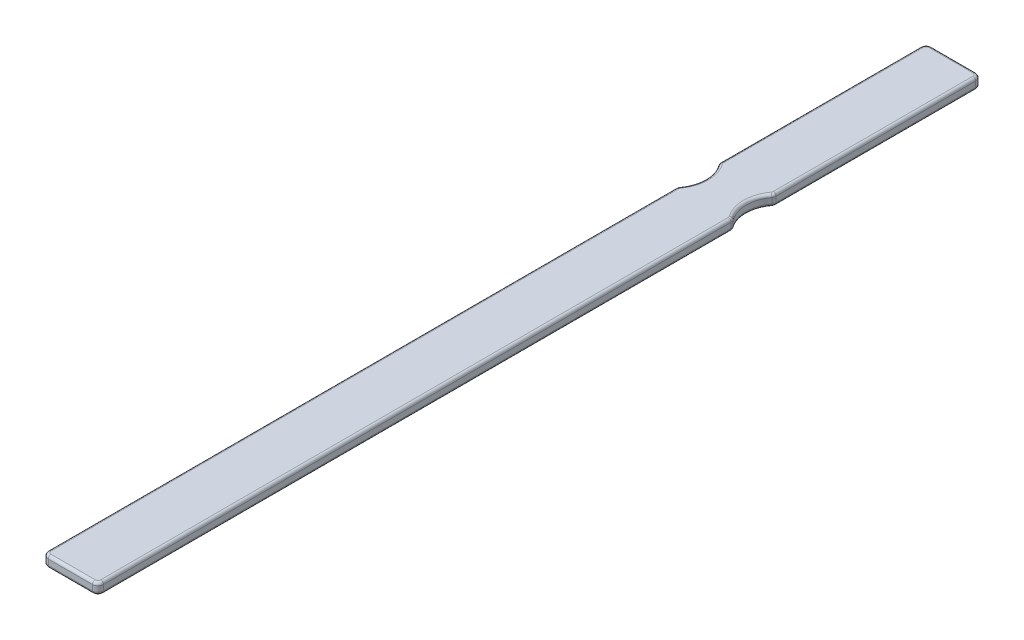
ISO-10303-21;
HEADER;
FILE_DESCRIPTION(('STEP AP214'),'2;1');
FILE_NAME('part.step','',(''),(''),'','','');
FILE_SCHEMA(('AUTOMOTIVE_DESIGN { 1 0 10303 214 1 1 1 1 }'));
ENDSEC;
DATA;
#1=APPLICATION_CONTEXT('core data for automotive mechanical design processes');
#2=APPLICATION_PROTOCOL_DEFINITION('international standard','automotive_design',2000,#1);
#3=PRODUCT_CONTEXT('',#1,'mechanical');
#4=PRODUCT('Part','Part','',(#3));
#5=PRODUCT_RELATED_PRODUCT_CATEGORY('part','',(#4));
#6=PRODUCT_DEFINITION_FORMATION('','',#4);
#7=PRODUCT_DEFINITION_CONTEXT('part definition',#1,'design');
#8=PRODUCT_DEFINITION('design','',#6,#7);
#9=PRODUCT_DEFINITION_SHAPE('','',#8);
#10=(LENGTH_UNIT() NAMED_UNIT(*) SI_UNIT(.MILLI.,.METRE.));
#11=(NAMED_UNIT(*) PLANE_ANGLE_UNIT() SI_UNIT($,.RADIAN.));
#12=(NAMED_UNIT(*) SI_UNIT($,.STERADIAN.) SOLID_ANGLE_UNIT());
#13=UNCERTAINTY_MEASURE_WITH_UNIT(LENGTH_MEASURE(1.E-05),#10,'distance_accuracy_value','');
#14=(GEOMETRIC_REPRESENTATION_CONTEXT(3) GLOBAL_UNCERTAINTY_ASSIGNED_CONTEXT((#13)) GLOBAL_UNIT_ASSIGNED_CONTEXT((#10,
#11,#12)) REPRESENTATION_CONTEXT('',''));
#15=CARTESIAN_POINT('',(0.,0.,0.));
#16=DIRECTION('',(0.,0.,1.));
#17=DIRECTION('',(1.,0.,0.));
#18=AXIS2_PLACEMENT_3D('',#15,#16,#17);
#19=CARTESIAN_POINT('',(-10.,4.,0.));
#20=DIRECTION('',(1.,0.,0.));
#21=DIRECTION('',(0.,0.,-1.));
#22=AXIS2_PLACEMENT_3D('',#19,#20,#21);
#23=PLANE('',#22);
#24=DIRECTION('',(0.,-1.,0.));
#25=VECTOR('',#24,1.);
#26=CARTESIAN_POINT('',(-10.,4.,-229.328096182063));
#27=LINE('',#26,#25);
#28=CARTESIAN_POINT('',(-10.,3.,-229.328096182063));
#29=VERTEX_POINT('',#28);
#30=CARTESIAN_POINT('',(-10.,1.,-229.328096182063));
#31=VERTEX_POINT('',#30);
#32=EDGE_CURVE('E570',#29,#31,#27,.T.);
#33=ORIENTED_EDGE('',*,*,#32,.T.);
#34=DIRECTION('',(0.,0.,1.));
#35=VECTOR('',#34,1.);
#36=CARTESIAN_POINT('',(-10.,1.,-2.));
#37=LINE('',#36,#35);
#38=CARTESIAN_POINT('',(-10.,1.,-2.));
#39=VERTEX_POINT('',#38);
#40=EDGE_CURVE('E304',#31,#39,#37,.T.);
#41=ORIENTED_EDGE('',*,*,#40,.T.);
#42=DIRECTION('',(0.,-1.,0.));
#43=VECTOR('',#42,1.);
#44=CARTESIAN_POINT('',(-10.,4.,-2.));
#45=LINE('',#44,#43);
#46=CARTESIAN_POINT('',(-10.,3.,-2.));
#47=VERTEX_POINT('',#46);
#48=EDGE_CURVE('E567',#39,#47,#45,.F.);
#49=ORIENTED_EDGE('',*,*,#48,.T.);
#50=DIRECTION('',(0.,0.,1.));
#51=VECTOR('',#50,1.);
#52=CARTESIAN_POINT('',(-10.,3.,0.));
#53=LINE('',#52,#51);
#54=EDGE_CURVE('E302',#47,#29,#53,.F.);
#55=ORIENTED_EDGE('',*,*,#54,.T.);
#56=EDGE_LOOP('',(#33,#41,#49,#55));
#57=FACE_BOUND('',#56,.T.);
#58=ADVANCED_FACE('F35',(#57),#23,.F.);
#59=CARTESIAN_POINT('',(-10.,4.,0.));
#60=DIRECTION('',(0.,0.,-1.));
#61=DIRECTION('',(-1.,0.,0.));
#62=AXIS2_PLACEMENT_3D('',#59,#60,#61);
#63=PLANE('',#62);
#64=DIRECTION('',(0.,-1.,0.));
#65=VECTOR('',#64,1.);
#66=CARTESIAN_POINT('',(-8.,4.,0.));
#67=LINE('',#66,#65);
#68=CARTESIAN_POINT('',(-8.,3.,0.));
#69=VERTEX_POINT('',#68);
#70=CARTESIAN_POINT('',(-8.,1.,0.));
#71=VERTEX_POINT('',#70);
#72=EDGE_CURVE('E482',#69,#71,#67,.T.);
#73=ORIENTED_EDGE('',*,*,#72,.T.);
#74=DIRECTION('',(1.,0.,0.));
#75=VECTOR('',#74,1.);
#76=CARTESIAN_POINT('',(8.,1.,0.));
#77=LINE('',#76,#75);
#78=CARTESIAN_POINT('',(8.,1.,0.));
#79=VERTEX_POINT('',#78);
#80=EDGE_CURVE('E312',#71,#79,#77,.T.);
#81=ORIENTED_EDGE('',*,*,#80,.T.);
#82=DIRECTION('',(0.,-1.,0.));
#83=VECTOR('',#82,1.);
#84=CARTESIAN_POINT('',(8.,4.,0.));
#85=LINE('',#84,#83);
#86=CARTESIAN_POINT('',(8.,3.,0.));
#87=VERTEX_POINT('',#86);
#88=EDGE_CURVE('E478',#79,#87,#85,.F.);
#89=ORIENTED_EDGE('',*,*,#88,.T.);
#90=DIRECTION('',(1.,0.,0.));
#91=VECTOR('',#90,1.);
#92=CARTESIAN_POINT('',(-10.,3.,0.));
#93=LINE('',#92,#91);
#94=EDGE_CURVE('E310',#87,#69,#93,.F.);
#95=ORIENTED_EDGE('',*,*,#94,.T.);
#96=EDGE_LOOP('',(#73,#81,#89,#95));
#97=FACE_BOUND('',#96,.T.);
#98=ADVANCED_FACE('F619',(#97),#63,.F.);
#99=CARTESIAN_POINT('',(10.,4.,0.));
#100=DIRECTION('',(-1.,0.,0.));
#101=DIRECTION('',(0.,0.,1.));
#102=AXIS2_PLACEMENT_3D('',#99,#100,#101);
#103=PLANE('',#102);
#104=DIRECTION('',(0.,-1.,0.));
#105=VECTOR('',#104,1.);
#106=CARTESIAN_POINT('',(10.,4.,-2.));
#107=LINE('',#106,#105);
#108=CARTESIAN_POINT('',(10.,3.,-2.));
#109=VERTEX_POINT('',#108);
#110=CARTESIAN_POINT('',(10.,1.,-2.));
#111=VERTEX_POINT('',#110);
#112=EDGE_CURVE('E561',#109,#111,#107,.T.);
#113=ORIENTED_EDGE('',*,*,#112,.T.);
#114=DIRECTION('',(0.,0.,-1.));
#115=VECTOR('',#114,1.);
#116=CARTESIAN_POINT('',(10.,1.,-229.328096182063));
#117=LINE('',#116,#115);
#118=CARTESIAN_POINT('',(10.,1.,-229.328096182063));
#119=VERTEX_POINT('',#118);
#120=EDGE_CURVE('E320',#111,#119,#117,.T.);
#121=ORIENTED_EDGE('',*,*,#120,.T.);
#122=DIRECTION('',(0.,-1.,0.));
#123=VECTOR('',#122,1.);
#124=CARTESIAN_POINT('',(10.,4.,-229.328096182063));
#125=LINE('',#124,#123);
#126=CARTESIAN_POINT('',(10.,3.,-229.328096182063));
#127=VERTEX_POINT('',#126);
#128=EDGE_CURVE('E564',#119,#127,#125,.F.);
#129=ORIENTED_EDGE('',*,*,#128,.T.);
#130=DIRECTION('',(0.,0.,-1.));
#131=VECTOR('',#130,1.);
#132=CARTESIAN_POINT('',(10.,3.,0.));
#133=LINE('',#132,#131);
#134=EDGE_CURVE('E318',#127,#109,#133,.F.);
#135=ORIENTED_EDGE('',*,*,#134,.T.);
#136=EDGE_LOOP('',(#113,#121,#129,#135));
#137=FACE_BOUND('',#136,.T.);
#138=ADVANCED_FACE('F705',(#137),#103,.F.);
#139=CARTESIAN_POINT('',(19.3674969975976,4.,-237.5));
#140=DIRECTION('',(0.,-1.,0.));
#141=DIRECTION('',(0.,0.,-1.));
#142=AXIS2_PLACEMENT_3D('',#139,#140,#141);
#143=CYLINDRICAL_SURFACE('',#142,12.);
#144=DIRECTION('',(0.,-1.,0.));
#145=VECTOR('',#144,1.);
#146=CARTESIAN_POINT('',(9.62392814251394,4.,-230.495511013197));
#147=LINE('',#146,#145);
#148=CARTESIAN_POINT('',(9.62392814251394,3.,-230.495511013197));
#149=VERTEX_POINT('',#148);
#150=CARTESIAN_POINT('',(9.62392814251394,1.,-230.495511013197));
#151=VERTEX_POINT('',#150);
#152=EDGE_CURVE('E553',#149,#151,#147,.T.);
#153=ORIENTED_EDGE('',*,*,#152,.T.);
#154=CARTESIAN_POINT('',(19.3674969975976,1.,-237.5));
#155=DIRECTION('',(0.,-1.,0.));
#156=DIRECTION('',(0.,0.,-1.));
#157=AXIS2_PLACEMENT_3D('',#154,#155,#156);
#158=CIRCLE('',#157,12.);
#159=CARTESIAN_POINT('',(9.62392814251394,1.,-244.504488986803));
#160=VERTEX_POINT('',#159);
#161=EDGE_CURVE('E329',#151,#160,#158,.T.);
#162=ORIENTED_EDGE('',*,*,#161,.T.);
#163=DIRECTION('',(0.,-1.,0.));
#164=VECTOR('',#163,1.);
#165=CARTESIAN_POINT('',(9.62392814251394,4.,-244.504488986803));
#166=LINE('',#165,#164);
#167=CARTESIAN_POINT('',(9.62392814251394,3.,-244.504488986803));
#168=VERTEX_POINT('',#167);
#169=EDGE_CURVE('E558',#160,#168,#166,.F.);
#170=ORIENTED_EDGE('',*,*,#169,.T.);
#171=CARTESIAN_POINT('',(19.3674969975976,3.,-237.5));
#172=DIRECTION('',(0.,-1.,0.));
#173=DIRECTION('',(0.,0.,-1.));
#174=AXIS2_PLACEMENT_3D('',#171,#172,#173);
#175=CIRCLE('',#174,12.);
#176=EDGE_CURVE('E327',#168,#149,#175,.F.);
#177=ORIENTED_EDGE('',*,*,#176,.T.);
#178=EDGE_LOOP('',(#153,#162,#170,#177));
#179=FACE_BOUND('',#178,.T.);
#180=ADVANCED_FACE('F650',(#179),#143,.F.);
#181=CARTESIAN_POINT('',(10.,4.,-245.));
#182=DIRECTION('',(-1.,0.,0.));
#183=DIRECTION('',(0.,0.,1.));
#184=AXIS2_PLACEMENT_3D('',#181,#182,#183);
#185=PLANE('',#184);
#186=DIRECTION('',(0.,-1.,0.));
#187=VECTOR('',#186,1.);
#188=CARTESIAN_POINT('',(10.,4.,-245.671903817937));
#189=LINE('',#188,#187);
#190=CARTESIAN_POINT('',(10.,3.,-245.671903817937));
#191=VERTEX_POINT('',#190);
#192=CARTESIAN_POINT('',(10.,1.,-245.671903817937));
#193=VERTEX_POINT('',#192);
#194=EDGE_CURVE('E551',#191,#193,#189,.T.);
#195=ORIENTED_EDGE('',*,*,#194,.T.);
#196=DIRECTION('',(0.,0.,-1.));
#197=VECTOR('',#196,1.);
#198=CARTESIAN_POINT('',(10.,1.,-318.));
#199=LINE('',#198,#197);
#200=CARTESIAN_POINT('',(10.,1.,-318.));
#201=VERTEX_POINT('',#200);
#202=EDGE_CURVE('E337',#193,#201,#199,.T.);
#203=ORIENTED_EDGE('',*,*,#202,.T.);
#204=DIRECTION('',(0.,-1.,0.));
#205=VECTOR('',#204,1.);
#206=CARTESIAN_POINT('',(10.,4.,-318.));
#207=LINE('',#206,#205);
#208=CARTESIAN_POINT('',(10.,3.,-318.));
#209=VERTEX_POINT('',#208);
#210=EDGE_CURVE('E408',#201,#209,#207,.F.);
#211=ORIENTED_EDGE('',*,*,#210,.T.);
#212=DIRECTION('',(0.,0.,-1.));
#213=VECTOR('',#212,1.);
#214=CARTESIAN_POINT('',(10.,3.,-245.));
#215=LINE('',#214,#213);
#216=EDGE_CURVE('E335',#209,#191,#215,.F.);
#217=ORIENTED_EDGE('',*,*,#216,.T.);
#218=EDGE_LOOP('',(#195,#203,#211,#217));
#219=FACE_BOUND('',#218,.T.);
#220=ADVANCED_FACE('F549',(#219),#185,.F.);
#221=CARTESIAN_POINT('',(-10.,4.,-320.));
#222=DIRECTION('',(0.,0.,1.));
#223=DIRECTION('',(1.,0.,0.));
#224=AXIS2_PLACEMENT_3D('',#221,#222,#223);
#225=PLANE('',#224);
#226=DIRECTION('',(0.,-1.,0.));
#227=VECTOR('',#226,1.);
#228=CARTESIAN_POINT('',(8.,4.,-320.));
#229=LINE('',#228,#227);
#230=CARTESIAN_POINT('',(8.,3.,-320.));
#231=VERTEX_POINT('',#230);
#232=CARTESIAN_POINT('',(8.,1.,-320.));
#233=VERTEX_POINT('',#232);
#234=EDGE_CURVE('E264',#231,#233,#229,.T.);
#235=ORIENTED_EDGE('',*,*,#234,.T.);
#236=DIRECTION('',(-1.,0.,0.));
#237=VECTOR('',#236,1.);
#238=CARTESIAN_POINT('',(-8.,1.,-320.));
#239=LINE('',#238,#237);
#240=CARTESIAN_POINT('',(-8.,1.,-320.));
#241=VERTEX_POINT('',#240);
#242=EDGE_CURVE('E280',#233,#241,#239,.T.);
#243=ORIENTED_EDGE('',*,*,#242,.T.);
#244=DIRECTION('',(0.,-1.,0.));
#245=VECTOR('',#244,1.);
#246=CARTESIAN_POINT('',(-8.,4.,-320.));
#247=LINE('',#246,#245);
#248=CARTESIAN_POINT('',(-8.,3.,-320.));
#249=VERTEX_POINT('',#248);
#250=EDGE_CURVE('E490',#241,#249,#247,.F.);
#251=ORIENTED_EDGE('',*,*,#250,.T.);
#252=DIRECTION('',(-1.,0.,0.));
#253=VECTOR('',#252,1.);
#254=CARTESIAN_POINT('',(-10.,3.,-320.));
#255=LINE('',#254,#253);
#256=EDGE_CURVE('E278',#249,#231,#255,.F.);
#257=ORIENTED_EDGE('',*,*,#256,.T.);
#258=EDGE_LOOP('',(#235,#243,#251,#257));
#259=FACE_BOUND('',#258,.T.);
#260=ADVANCED_FACE('F535',(#259),#225,.F.);
#261=CARTESIAN_POINT('',(-10.,4.,-245.));
#262=DIRECTION('',(1.,0.,0.));
#263=DIRECTION('',(0.,0.,-1.));
#264=AXIS2_PLACEMENT_3D('',#261,#262,#263);
#265=PLANE('',#264);
#266=DIRECTION('',(0.,-1.,0.));
#267=VECTOR('',#266,1.);
#268=CARTESIAN_POINT('',(-10.,4.,-318.));
#269=LINE('',#268,#267);
#270=CARTESIAN_POINT('',(-10.,3.,-318.));
#271=VERTEX_POINT('',#270);
#272=CARTESIAN_POINT('',(-10.,1.,-318.));
#273=VERTEX_POINT('',#272);
#274=EDGE_CURVE('E479',#271,#273,#269,.T.);
#275=ORIENTED_EDGE('',*,*,#274,.T.);
#276=DIRECTION('',(0.,0.,1.));
#277=VECTOR('',#276,1.);
#278=CARTESIAN_POINT('',(-10.,1.,-245.671903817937));
#279=LINE('',#278,#277);
#280=CARTESIAN_POINT('',(-10.,1.,-245.671903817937));
#281=VERTEX_POINT('',#280);
#282=EDGE_CURVE('E288',#273,#281,#279,.T.);
#283=ORIENTED_EDGE('',*,*,#282,.T.);
#284=DIRECTION('',(0.,-1.,0.));
#285=VECTOR('',#284,1.);
#286=CARTESIAN_POINT('',(-10.,4.,-245.671903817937));
#287=LINE('',#286,#285);
#288=CARTESIAN_POINT('',(-10.,3.,-245.671903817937));
#289=VERTEX_POINT('',#288);
#290=EDGE_CURVE('E469',#281,#289,#287,.F.);
#291=ORIENTED_EDGE('',*,*,#290,.T.);
#292=DIRECTION('',(0.,0.,1.));
#293=VECTOR('',#292,1.);
#294=CARTESIAN_POINT('',(-10.,3.,-245.));
#295=LINE('',#294,#293);
#296=EDGE_CURVE('E286',#289,#271,#295,.F.);
#297=ORIENTED_EDGE('',*,*,#296,.T.);
#298=EDGE_LOOP('',(#275,#283,#291,#297));
#299=FACE_BOUND('',#298,.T.);
#300=ADVANCED_FACE('F475',(#299),#265,.F.);
#301=CARTESIAN_POINT('',(-19.3674969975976,4.,-237.5));
#302=DIRECTION('',(0.,-1.,0.));
#303=DIRECTION('',(0.,0.,-1.));
#304=AXIS2_PLACEMENT_3D('',#301,#302,#303);
#305=CYLINDRICAL_SURFACE('',#304,12.);
#306=DIRECTION('',(0.,-1.,0.));
#307=VECTOR('',#306,1.);
#308=CARTESIAN_POINT('',(-9.62392814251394,4.,-244.504488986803));
#309=LINE('',#308,#307);
#310=CARTESIAN_POINT('',(-9.62392814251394,3.,-244.504488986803));
#311=VERTEX_POINT('',#310);
#312=CARTESIAN_POINT('',(-9.62392814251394,1.,-244.504488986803));
#313=VERTEX_POINT('',#312);
#314=EDGE_CURVE('E472',#311,#313,#309,.T.);
#315=ORIENTED_EDGE('',*,*,#314,.T.);
#316=CARTESIAN_POINT('',(-19.3674969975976,1.,-237.5));
#317=DIRECTION('',(0.,-1.,0.));
#318=DIRECTION('',(0.,0.,-1.));
#319=AXIS2_PLACEMENT_3D('',#316,#317,#318);
#320=CIRCLE('',#319,12.);
#321=CARTESIAN_POINT('',(-9.62392814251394,1.,-230.495511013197));
#322=VERTEX_POINT('',#321);
#323=EDGE_CURVE('E296',#313,#322,#320,.T.);
#324=ORIENTED_EDGE('',*,*,#323,.T.);
#325=DIRECTION('',(0.,-1.,0.));
#326=VECTOR('',#325,1.);
#327=CARTESIAN_POINT('',(-9.62392814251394,4.,-230.495511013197));
#328=LINE('',#327,#326);
#329=CARTESIAN_POINT('',(-9.62392814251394,3.,-230.495511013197));
#330=VERTEX_POINT('',#329);
#331=EDGE_CURVE('E484',#322,#330,#328,.F.);
#332=ORIENTED_EDGE('',*,*,#331,.T.);
#333=CARTESIAN_POINT('',(-19.3674969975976,3.,-237.5));
#334=DIRECTION('',(0.,-1.,0.));
#335=DIRECTION('',(0.,0.,-1.));
#336=AXIS2_PLACEMENT_3D('',#333,#334,#335);
#337=CIRCLE('',#336,12.);
#338=EDGE_CURVE('E294',#330,#311,#337,.F.);
#339=ORIENTED_EDGE('',*,*,#338,.T.);
#340=EDGE_LOOP('',(#315,#324,#332,#339));
#341=FACE_BOUND('',#340,.T.);
#342=ADVANCED_FACE('F576',(#341),#305,.F.);
#343=CARTESIAN_POINT('',(-19.3674969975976,4.,-237.5));
#344=DIRECTION('',(0.,-1.,0.));
#345=DIRECTION('',(0.,0.,-1.));
#346=AXIS2_PLACEMENT_3D('',#343,#344,#345);
#347=PLANE('',#346);
#348=DIRECTION('',(0.,0.,-1.));
#349=VECTOR('',#348,1.);
#350=CARTESIAN_POINT('',(9.,4.,-237.5));
#351=LINE('',#350,#349);
#352=CARTESIAN_POINT('',(9.,4.,-2.));
#353=VERTEX_POINT('',#352);
#354=CARTESIAN_POINT('',(9.,4.,-229.328096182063));
#355=VERTEX_POINT('',#354);
#356=EDGE_CURVE('E44',#353,#355,#351,.T.);
#357=ORIENTED_EDGE('',*,*,#356,.T.);
#358=CARTESIAN_POINT('',(8.,4.,-229.328096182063));
#359=DIRECTION('',(0.,-1.,0.));
#360=DIRECTION('',(0.,0.,-1.));
#361=AXIS2_PLACEMENT_3D('',#358,#359,#360);
#362=CIRCLE('',#361,1.);
#363=CARTESIAN_POINT('',(8.81196407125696,4.,-229.91180359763));
#364=VERTEX_POINT('',#363);
#365=EDGE_CURVE('E11',#355,#364,#362,.F.);
#366=ORIENTED_EDGE('',*,*,#365,.T.);
#367=CARTESIAN_POINT('',(19.3674969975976,4.,-237.5));
#368=DIRECTION('',(0.,-1.,0.));
#369=DIRECTION('',(0.,0.,-1.));
#370=AXIS2_PLACEMENT_3D('',#367,#368,#369);
#371=CIRCLE('',#370,13.);
#372=CARTESIAN_POINT('',(8.81196407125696,4.,-245.08819640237));
#373=VERTEX_POINT('',#372);
#374=EDGE_CURVE('E339',#364,#373,#371,.T.);
#375=ORIENTED_EDGE('',*,*,#374,.T.);
#376=CARTESIAN_POINT('',(8.,4.,-245.671903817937));
#377=DIRECTION('',(0.,-1.,0.));
#378=DIRECTION('',(0.,0.,-1.));
#379=AXIS2_PLACEMENT_3D('',#376,#377,#378);
#380=CIRCLE('',#379,1.);
#381=CARTESIAN_POINT('',(9.,4.,-245.671903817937));
#382=VERTEX_POINT('',#381);
#383=EDGE_CURVE('E341',#373,#382,#380,.F.);
#384=ORIENTED_EDGE('',*,*,#383,.T.);
#385=DIRECTION('',(0.,0.,-1.));
#386=VECTOR('',#385,1.);
#387=CARTESIAN_POINT('',(9.,4.,-237.5));
#388=LINE('',#387,#386);
#389=CARTESIAN_POINT('',(9.,4.,-318.));
#390=VERTEX_POINT('',#389);
#391=EDGE_CURVE('E343',#382,#390,#388,.T.);
#392=ORIENTED_EDGE('',*,*,#391,.T.);
#393=CARTESIAN_POINT('',(8.,4.,-318.));
#394=DIRECTION('',(0.,-1.,0.));
#395=DIRECTION('',(0.,0.,-1.));
#396=AXIS2_PLACEMENT_3D('',#393,#394,#395);
#397=CIRCLE('',#396,1.);
#398=CARTESIAN_POINT('',(8.,4.,-319.));
#399=VERTEX_POINT('',#398);
#400=EDGE_CURVE('E345',#390,#399,#397,.F.);
#401=ORIENTED_EDGE('',*,*,#400,.T.);
#402=DIRECTION('',(-1.,0.,0.));
#403=VECTOR('',#402,1.);
#404=CARTESIAN_POINT('',(-19.3674969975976,4.,-319.));
#405=LINE('',#404,#403);
#406=CARTESIAN_POINT('',(-8.,4.,-319.));
#407=VERTEX_POINT('',#406);
#408=EDGE_CURVE('E347',#399,#407,#405,.T.);
#409=ORIENTED_EDGE('',*,*,#408,.T.);
#410=CARTESIAN_POINT('',(-8.,4.,-318.));
#411=DIRECTION('',(0.,-1.,0.));
#412=DIRECTION('',(0.,0.,-1.));
#413=AXIS2_PLACEMENT_3D('',#410,#411,#412);
#414=CIRCLE('',#413,1.);
#415=CARTESIAN_POINT('',(-9.,4.,-318.));
#416=VERTEX_POINT('',#415);
#417=EDGE_CURVE('E349',#407,#416,#414,.F.);
#418=ORIENTED_EDGE('',*,*,#417,.T.);
#419=DIRECTION('',(0.,0.,1.));
#420=VECTOR('',#419,1.);
#421=CARTESIAN_POINT('',(-9.,4.,-237.5));
#422=LINE('',#421,#420);
#423=CARTESIAN_POINT('',(-9.,4.,-245.671903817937));
#424=VERTEX_POINT('',#423);
#425=EDGE_CURVE('E351',#416,#424,#422,.T.);
#426=ORIENTED_EDGE('',*,*,#425,.T.);
#427=CARTESIAN_POINT('',(-8.,4.,-245.671903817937));
#428=DIRECTION('',(0.,-1.,0.));
#429=DIRECTION('',(0.,0.,-1.));
#430=AXIS2_PLACEMENT_3D('',#427,#428,#429);
#431=CIRCLE('',#430,1.);
#432=CARTESIAN_POINT('',(-8.81196407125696,4.,-245.08819640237));
#433=VERTEX_POINT('',#432);
#434=EDGE_CURVE('E353',#424,#433,#431,.F.);
#435=ORIENTED_EDGE('',*,*,#434,.T.);
#436=CARTESIAN_POINT('',(-19.3674969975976,4.,-237.5));
#437=DIRECTION('',(0.,-1.,0.));
#438=DIRECTION('',(0.,0.,-1.));
#439=AXIS2_PLACEMENT_3D('',#436,#437,#438);
#440=CIRCLE('',#439,13.);
#441=CARTESIAN_POINT('',(-8.81196407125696,4.,-229.91180359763));
#442=VERTEX_POINT('',#441);
#443=EDGE_CURVE('E355',#433,#442,#440,.T.);
#444=ORIENTED_EDGE('',*,*,#443,.T.);
#445=CARTESIAN_POINT('',(-8.,4.,-229.328096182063));
#446=DIRECTION('',(0.,-1.,0.));
#447=DIRECTION('',(0.,0.,-1.));
#448=AXIS2_PLACEMENT_3D('',#445,#446,#447);
#449=CIRCLE('',#448,1.);
#450=CARTESIAN_POINT('',(-9.,4.,-229.328096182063));
#451=VERTEX_POINT('',#450);
#452=EDGE_CURVE('E357',#442,#451,#449,.F.);
#453=ORIENTED_EDGE('',*,*,#452,.T.);
#454=DIRECTION('',(0.,0.,1.));
#455=VECTOR('',#454,1.);
#456=CARTESIAN_POINT('',(-9.,4.,-237.5));
#457=LINE('',#456,#455);
#458=CARTESIAN_POINT('',(-9.,4.,-2.));
#459=VERTEX_POINT('',#458);
#460=EDGE_CURVE('E359',#451,#459,#457,.T.);
#461=ORIENTED_EDGE('',*,*,#460,.T.);
#462=CARTESIAN_POINT('',(-8.,4.,-2.));
#463=DIRECTION('',(0.,-1.,0.));
#464=DIRECTION('',(0.,0.,-1.));
#465=AXIS2_PLACEMENT_3D('',#462,#463,#464);
#466=CIRCLE('',#465,1.);
#467=CARTESIAN_POINT('',(-8.,4.,-1.));
#468=VERTEX_POINT('',#467);
#469=EDGE_CURVE('E361',#459,#468,#466,.F.);
#470=ORIENTED_EDGE('',*,*,#469,.T.);
#471=DIRECTION('',(1.,0.,0.));
#472=VECTOR('',#471,1.);
#473=CARTESIAN_POINT('',(-19.3674969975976,4.,-1.));
#474=LINE('',#473,#472);
#475=CARTESIAN_POINT('',(8.,4.,-1.));
#476=VERTEX_POINT('',#475);
#477=EDGE_CURVE('E363',#468,#476,#474,.T.);
#478=ORIENTED_EDGE('',*,*,#477,.T.);
#479=CARTESIAN_POINT('',(8.,4.,-2.));
#480=DIRECTION('',(0.,-1.,0.));
#481=DIRECTION('',(0.,0.,-1.));
#482=AXIS2_PLACEMENT_3D('',#479,#480,#481);
#483=CIRCLE('',#482,1.);
#484=EDGE_CURVE('E55',#476,#353,#483,.F.);
#485=ORIENTED_EDGE('',*,*,#484,.T.);
#486=EDGE_LOOP('',(#357,#366,#375,#384,#392,#401,#409,#418,#426,#435,#444,#453,#461,#470,#478,#485));
#487=FACE_BOUND('',#486,.T.);
#488=ADVANCED_FACE('F637',(#487),#347,.F.);
#489=CARTESIAN_POINT('',(-19.3674969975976,0.,-237.5));
#490=DIRECTION('',(0.,-1.,0.));
#491=DIRECTION('',(0.,0.,-1.));
#492=AXIS2_PLACEMENT_3D('',#489,#490,#491);
#493=PLANE('',#492);
#494=DIRECTION('',(-1.,0.,0.));
#495=VECTOR('',#494,1.);
#496=CARTESIAN_POINT('',(8.,0.,-319.));
#497=LINE('',#496,#495);
#498=CARTESIAN_POINT('',(-8.,0.,-319.));
#499=VERTEX_POINT('',#498);
#500=CARTESIAN_POINT('',(8.,0.,-319.));
#501=VERTEX_POINT('',#500);
#502=EDGE_CURVE('E268',#499,#501,#497,.F.);
#503=ORIENTED_EDGE('',*,*,#502,.T.);
#504=CARTESIAN_POINT('',(8.,0.,-318.));
#505=DIRECTION('',(0.,-1.,0.));
#506=DIRECTION('',(0.,0.,-1.));
#507=AXIS2_PLACEMENT_3D('',#504,#505,#506);
#508=CIRCLE('',#507,1.);
#509=CARTESIAN_POINT('',(9.,0.,-318.));
#510=VERTEX_POINT('',#509);
#511=EDGE_CURVE('E249',#501,#510,#508,.T.);
#512=ORIENTED_EDGE('',*,*,#511,.T.);
#513=DIRECTION('',(0.,0.,-1.));
#514=VECTOR('',#513,1.);
#515=CARTESIAN_POINT('',(9.,0.,-245.671903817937));
#516=LINE('',#515,#514);
#517=CARTESIAN_POINT('',(9.,0.,-245.671903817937));
#518=VERTEX_POINT('',#517);
#519=EDGE_CURVE('E257',#510,#518,#516,.F.);
#520=ORIENTED_EDGE('',*,*,#519,.T.);
#521=CARTESIAN_POINT('',(8.,0.,-245.671903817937));
#522=DIRECTION('',(0.,-1.,0.));
#523=DIRECTION('',(0.,0.,-1.));
#524=AXIS2_PLACEMENT_3D('',#521,#522,#523);
#525=CIRCLE('',#524,1.);
#526=CARTESIAN_POINT('',(8.81196407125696,0.,-245.08819640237));
#527=VERTEX_POINT('',#526);
#528=EDGE_CURVE('E263',#518,#527,#525,.T.);
#529=ORIENTED_EDGE('',*,*,#528,.T.);
#530=CARTESIAN_POINT('',(19.3674969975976,0.,-237.5));
#531=DIRECTION('',(0.,-1.,0.));
#532=DIRECTION('',(0.,0.,-1.));
#533=AXIS2_PLACEMENT_3D('',#530,#531,#532);
#534=CIRCLE('',#533,13.);
#535=CARTESIAN_POINT('',(8.81196407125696,0.,-229.91180359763));
#536=VERTEX_POINT('',#535);
#537=EDGE_CURVE('E496',#527,#536,#534,.F.);
#538=ORIENTED_EDGE('',*,*,#537,.T.);
#539=CARTESIAN_POINT('',(8.,0.,-229.328096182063));
#540=DIRECTION('',(0.,-1.,0.));
#541=DIRECTION('',(0.,0.,-1.));
#542=AXIS2_PLACEMENT_3D('',#539,#540,#541);
#543=CIRCLE('',#542,1.);
#544=CARTESIAN_POINT('',(9.,0.,-229.328096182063));
#545=VERTEX_POINT('',#544);
#546=EDGE_CURVE('E498',#536,#545,#543,.T.);
#547=ORIENTED_EDGE('',*,*,#546,.T.);
#548=DIRECTION('',(0.,0.,-1.));
#549=VECTOR('',#548,1.);
#550=CARTESIAN_POINT('',(9.,0.,-2.));
#551=LINE('',#550,#549);
#552=CARTESIAN_POINT('',(9.,0.,-2.));
#553=VERTEX_POINT('',#552);
#554=EDGE_CURVE('E500',#545,#553,#551,.F.);
#555=ORIENTED_EDGE('',*,*,#554,.T.);
#556=CARTESIAN_POINT('',(8.,0.,-2.));
#557=DIRECTION('',(0.,-1.,0.));
#558=DIRECTION('',(0.,0.,-1.));
#559=AXIS2_PLACEMENT_3D('',#556,#557,#558);
#560=CIRCLE('',#559,1.);
#561=CARTESIAN_POINT('',(8.,0.,-1.));
#562=VERTEX_POINT('',#561);
#563=EDGE_CURVE('E502',#553,#562,#560,.T.);
#564=ORIENTED_EDGE('',*,*,#563,.T.);
#565=DIRECTION('',(1.,0.,0.));
#566=VECTOR('',#565,1.);
#567=CARTESIAN_POINT('',(-8.,0.,-1.));
#568=LINE('',#567,#566);
#569=CARTESIAN_POINT('',(-8.,0.,-1.));
#570=VERTEX_POINT('',#569);
#571=EDGE_CURVE('E504',#562,#570,#568,.F.);
#572=ORIENTED_EDGE('',*,*,#571,.T.);
#573=CARTESIAN_POINT('',(-8.,0.,-2.));
#574=DIRECTION('',(0.,-1.,0.));
#575=DIRECTION('',(0.,0.,-1.));
#576=AXIS2_PLACEMENT_3D('',#573,#574,#575);
#577=CIRCLE('',#576,1.);
#578=CARTESIAN_POINT('',(-9.,0.,-2.));
#579=VERTEX_POINT('',#578);
#580=EDGE_CURVE('E506',#570,#579,#577,.T.);
#581=ORIENTED_EDGE('',*,*,#580,.T.);
#582=DIRECTION('',(0.,0.,1.));
#583=VECTOR('',#582,1.);
#584=CARTESIAN_POINT('',(-9.,0.,-229.328096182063));
#585=LINE('',#584,#583);
#586=CARTESIAN_POINT('',(-9.,0.,-229.328096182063));
#587=VERTEX_POINT('',#586);
#588=EDGE_CURVE('E508',#579,#587,#585,.F.);
#589=ORIENTED_EDGE('',*,*,#588,.T.);
#590=CARTESIAN_POINT('',(-8.,0.,-229.328096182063));
#591=DIRECTION('',(0.,-1.,0.));
#592=DIRECTION('',(0.,0.,-1.));
#593=AXIS2_PLACEMENT_3D('',#590,#591,#592);
#594=CIRCLE('',#593,1.);
#595=CARTESIAN_POINT('',(-8.81196407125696,0.,-229.91180359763));
#596=VERTEX_POINT('',#595);
#597=EDGE_CURVE('E510',#587,#596,#594,.T.);
#598=ORIENTED_EDGE('',*,*,#597,.T.);
#599=CARTESIAN_POINT('',(-19.3674969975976,0.,-237.5));
#600=DIRECTION('',(0.,-1.,0.));
#601=DIRECTION('',(0.,0.,-1.));
#602=AXIS2_PLACEMENT_3D('',#599,#600,#601);
#603=CIRCLE('',#602,13.);
#604=CARTESIAN_POINT('',(-8.81196407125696,0.,-245.08819640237));
#605=VERTEX_POINT('',#604);
#606=EDGE_CURVE('E512',#596,#605,#603,.F.);
#607=ORIENTED_EDGE('',*,*,#606,.T.);
#608=CARTESIAN_POINT('',(-8.,0.,-245.671903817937));
#609=DIRECTION('',(0.,-1.,0.));
#610=DIRECTION('',(0.,0.,-1.));
#611=AXIS2_PLACEMENT_3D('',#608,#609,#610);
#612=CIRCLE('',#611,1.);
#613=CARTESIAN_POINT('',(-9.,0.,-245.671903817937));
#614=VERTEX_POINT('',#613);
#615=EDGE_CURVE('E514',#605,#614,#612,.T.);
#616=ORIENTED_EDGE('',*,*,#615,.T.);
#617=DIRECTION('',(0.,0.,1.));
#618=VECTOR('',#617,1.);
#619=CARTESIAN_POINT('',(-9.,0.,-318.));
#620=LINE('',#619,#618);
#621=CARTESIAN_POINT('',(-9.,0.,-318.));
#622=VERTEX_POINT('',#621);
#623=EDGE_CURVE('E516',#614,#622,#620,.F.);
#624=ORIENTED_EDGE('',*,*,#623,.T.);
#625=CARTESIAN_POINT('',(-8.,0.,-318.));
#626=DIRECTION('',(0.,-1.,0.));
#627=DIRECTION('',(0.,0.,-1.));
#628=AXIS2_PLACEMENT_3D('',#625,#626,#627);
#629=CIRCLE('',#628,1.);
#630=EDGE_CURVE('E273',#622,#499,#629,.T.);
#631=ORIENTED_EDGE('',*,*,#630,.T.);
#632=EDGE_LOOP('',(#503,#512,#520,#529,#538,#547,#555,#564,#572,#581,#589,#598,#607,#616,#624,#631));
#633=FACE_BOUND('',#632,.T.);
#634=ADVANCED_FACE('F266',(#633),#493,.T.);
#635=CARTESIAN_POINT('',(8.,4.,-245.671903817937));
#636=DIRECTION('',(0.,-1.,0.));
#637=DIRECTION('',(0.,0.,-1.));
#638=AXIS2_PLACEMENT_3D('',#635,#636,#637);
#639=CYLINDRICAL_SURFACE('',#638,2.);
#640=ORIENTED_EDGE('',*,*,#169,.F.);
#641=CARTESIAN_POINT('',(8.,1.,-245.671903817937));
#642=DIRECTION('',(0.,-1.,0.));
#643=DIRECTION('',(0.,0.,-1.));
#644=AXIS2_PLACEMENT_3D('',#641,#642,#643);
#645=CIRCLE('',#644,2.);
#646=EDGE_CURVE('E333',#160,#193,#645,.F.);
#647=ORIENTED_EDGE('',*,*,#646,.T.);
#648=ORIENTED_EDGE('',*,*,#194,.F.);
#649=CARTESIAN_POINT('',(8.,3.,-245.671903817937));
#650=DIRECTION('',(0.,-1.,0.));
#651=DIRECTION('',(0.,0.,-1.));
#652=AXIS2_PLACEMENT_3D('',#649,#650,#651);
#653=CIRCLE('',#652,2.);
#654=EDGE_CURVE('E331',#191,#168,#653,.T.);
#655=ORIENTED_EDGE('',*,*,#654,.T.);
#656=EDGE_LOOP('',(#640,#647,#648,#655));
#657=FACE_BOUND('',#656,.T.);
#658=ADVANCED_FACE('F668',(#657),#639,.T.);
#659=CARTESIAN_POINT('',(8.,4.,-229.328096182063));
#660=DIRECTION('',(0.,-1.,0.));
#661=DIRECTION('',(0.,0.,-1.));
#662=AXIS2_PLACEMENT_3D('',#659,#660,#661);
#663=CYLINDRICAL_SURFACE('',#662,2.);
#664=ORIENTED_EDGE('',*,*,#128,.F.);
#665=CARTESIAN_POINT('',(8.,1.,-229.328096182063));
#666=DIRECTION('',(0.,-1.,0.));
#667=DIRECTION('',(0.,0.,-1.));
#668=AXIS2_PLACEMENT_3D('',#665,#666,#667);
#669=CIRCLE('',#668,2.);
#670=EDGE_CURVE('E325',#119,#151,#669,.F.);
#671=ORIENTED_EDGE('',*,*,#670,.T.);
#672=ORIENTED_EDGE('',*,*,#152,.F.);
#673=CARTESIAN_POINT('',(8.,3.,-229.328096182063));
#674=DIRECTION('',(0.,-1.,0.));
#675=DIRECTION('',(0.,0.,-1.));
#676=AXIS2_PLACEMENT_3D('',#673,#674,#675);
#677=CIRCLE('',#676,2.);
#678=EDGE_CURVE('E322',#149,#127,#677,.T.);
#679=ORIENTED_EDGE('',*,*,#678,.T.);
#680=EDGE_LOOP('',(#664,#671,#672,#679));
#681=FACE_BOUND('',#680,.T.);
#682=ADVANCED_FACE('F655',(#681),#663,.T.);
#683=CARTESIAN_POINT('',(-8.,4.,-229.328096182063));
#684=DIRECTION('',(0.,-1.,0.));
#685=DIRECTION('',(0.,0.,-1.));
#686=AXIS2_PLACEMENT_3D('',#683,#684,#685);
#687=CYLINDRICAL_SURFACE('',#686,2.);
#688=ORIENTED_EDGE('',*,*,#331,.F.);
#689=CARTESIAN_POINT('',(-8.,1.,-229.328096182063));
#690=DIRECTION('',(0.,-1.,0.));
#691=DIRECTION('',(0.,0.,-1.));
#692=AXIS2_PLACEMENT_3D('',#689,#690,#691);
#693=CIRCLE('',#692,2.);
#694=EDGE_CURVE('E300',#322,#31,#693,.F.);
#695=ORIENTED_EDGE('',*,*,#694,.T.);
#696=ORIENTED_EDGE('',*,*,#32,.F.);
#697=CARTESIAN_POINT('',(-8.,3.,-229.328096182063));
#698=DIRECTION('',(0.,-1.,0.));
#699=DIRECTION('',(0.,0.,-1.));
#700=AXIS2_PLACEMENT_3D('',#697,#698,#699);
#701=CIRCLE('',#700,2.);
#702=EDGE_CURVE('E298',#29,#330,#701,.T.);
#703=ORIENTED_EDGE('',*,*,#702,.T.);
#704=EDGE_LOOP('',(#688,#695,#696,#703));
#705=FACE_BOUND('',#704,.T.);
#706=ADVANCED_FACE('F580',(#705),#687,.T.);
#707=CARTESIAN_POINT('',(-8.,4.,-245.671903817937));
#708=DIRECTION('',(0.,-1.,0.));
#709=DIRECTION('',(0.,0.,-1.));
#710=AXIS2_PLACEMENT_3D('',#707,#708,#709);
#711=CYLINDRICAL_SURFACE('',#710,2.);
#712=ORIENTED_EDGE('',*,*,#290,.F.);
#713=CARTESIAN_POINT('',(-8.,1.,-245.671903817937));
#714=DIRECTION('',(0.,-1.,0.));
#715=DIRECTION('',(0.,0.,-1.));
#716=AXIS2_PLACEMENT_3D('',#713,#714,#715);
#717=CIRCLE('',#716,2.);
#718=EDGE_CURVE('E292',#281,#313,#717,.F.);
#719=ORIENTED_EDGE('',*,*,#718,.T.);
#720=ORIENTED_EDGE('',*,*,#314,.F.);
#721=CARTESIAN_POINT('',(-8.,3.,-245.671903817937));
#722=DIRECTION('',(0.,-1.,0.));
#723=DIRECTION('',(0.,0.,-1.));
#724=AXIS2_PLACEMENT_3D('',#721,#722,#723);
#725=CIRCLE('',#724,2.);
#726=EDGE_CURVE('E290',#311,#289,#725,.T.);
#727=ORIENTED_EDGE('',*,*,#726,.T.);
#728=EDGE_LOOP('',(#712,#719,#720,#727));
#729=FACE_BOUND('',#728,.T.);
#730=ADVANCED_FACE('F468',(#729),#711,.T.);
#731=CARTESIAN_POINT('',(-8.,4.,-2.));
#732=DIRECTION('',(0.,-1.,0.));
#733=DIRECTION('',(0.,0.,-1.));
#734=AXIS2_PLACEMENT_3D('',#731,#732,#733);
#735=CYLINDRICAL_SURFACE('',#734,2.);
#736=ORIENTED_EDGE('',*,*,#48,.F.);
#737=CARTESIAN_POINT('',(-8.,1.,-2.));
#738=DIRECTION('',(0.,-1.,0.));
#739=DIRECTION('',(0.,0.,-1.));
#740=AXIS2_PLACEMENT_3D('',#737,#738,#739);
#741=CIRCLE('',#740,2.);
#742=EDGE_CURVE('E308',#39,#71,#741,.F.);
#743=ORIENTED_EDGE('',*,*,#742,.T.);
#744=ORIENTED_EDGE('',*,*,#72,.F.);
#745=CARTESIAN_POINT('',(-8.,3.,-2.));
#746=DIRECTION('',(0.,-1.,0.));
#747=DIRECTION('',(0.,0.,-1.));
#748=AXIS2_PLACEMENT_3D('',#745,#746,#747);
#749=CIRCLE('',#748,2.);
#750=EDGE_CURVE('E306',#69,#47,#749,.T.);
#751=ORIENTED_EDGE('',*,*,#750,.T.);
#752=EDGE_LOOP('',(#736,#743,#744,#751));
#753=FACE_BOUND('',#752,.T.);
#754=ADVANCED_FACE('F605',(#753),#735,.T.);
#755=CARTESIAN_POINT('',(8.,4.,-2.));
#756=DIRECTION('',(0.,-1.,0.));
#757=DIRECTION('',(0.,0.,-1.));
#758=AXIS2_PLACEMENT_3D('',#755,#756,#757);
#759=CYLINDRICAL_SURFACE('',#758,2.);
#760=ORIENTED_EDGE('',*,*,#88,.F.);
#761=CARTESIAN_POINT('',(8.,1.,-2.));
#762=DIRECTION('',(0.,-1.,0.));
#763=DIRECTION('',(0.,0.,-1.));
#764=AXIS2_PLACEMENT_3D('',#761,#762,#763);
#765=CIRCLE('',#764,2.);
#766=EDGE_CURVE('E316',#79,#111,#765,.F.);
#767=ORIENTED_EDGE('',*,*,#766,.T.);
#768=ORIENTED_EDGE('',*,*,#112,.F.);
#769=CARTESIAN_POINT('',(8.,3.,-2.));
#770=DIRECTION('',(0.,-1.,0.));
#771=DIRECTION('',(0.,0.,-1.));
#772=AXIS2_PLACEMENT_3D('',#769,#770,#771);
#773=CIRCLE('',#772,2.);
#774=EDGE_CURVE('E314',#109,#87,#773,.T.);
#775=ORIENTED_EDGE('',*,*,#774,.T.);
#776=EDGE_LOOP('',(#760,#767,#768,#775));
#777=FACE_BOUND('',#776,.T.);
#778=ADVANCED_FACE('F622',(#777),#759,.T.);
#779=CARTESIAN_POINT('',(8.,4.,-318.));
#780=DIRECTION('',(0.,-1.,0.));
#781=DIRECTION('',(0.,0.,-1.));
#782=AXIS2_PLACEMENT_3D('',#779,#780,#781);
#783=CYLINDRICAL_SURFACE('',#782,2.);
#784=ORIENTED_EDGE('',*,*,#210,.F.);
#785=CARTESIAN_POINT('',(8.,1.,-318.));
#786=DIRECTION('',(0.,-1.,0.));
#787=DIRECTION('',(0.,0.,-1.));
#788=AXIS2_PLACEMENT_3D('',#785,#786,#787);
#789=CIRCLE('',#788,2.);
#790=EDGE_CURVE('E251',#201,#233,#789,.F.);
#791=ORIENTED_EDGE('',*,*,#790,.T.);
#792=ORIENTED_EDGE('',*,*,#234,.F.);
#793=CARTESIAN_POINT('',(8.,3.,-318.));
#794=DIRECTION('',(0.,-1.,0.));
#795=DIRECTION('',(0.,0.,-1.));
#796=AXIS2_PLACEMENT_3D('',#793,#794,#795);
#797=CIRCLE('',#796,2.);
#798=EDGE_CURVE('E270',#231,#209,#797,.T.);
#799=ORIENTED_EDGE('',*,*,#798,.T.);
#800=EDGE_LOOP('',(#784,#791,#792,#799));
#801=FACE_BOUND('',#800,.T.);
#802=ADVANCED_FACE('F532',(#801),#783,.T.);
#803=CARTESIAN_POINT('',(-8.,4.,-318.));
#804=DIRECTION('',(0.,-1.,0.));
#805=DIRECTION('',(0.,0.,-1.));
#806=AXIS2_PLACEMENT_3D('',#803,#804,#805);
#807=CYLINDRICAL_SURFACE('',#806,2.);
#808=ORIENTED_EDGE('',*,*,#250,.F.);
#809=CARTESIAN_POINT('',(-8.,1.,-318.));
#810=DIRECTION('',(0.,-1.,0.));
#811=DIRECTION('',(0.,0.,-1.));
#812=AXIS2_PLACEMENT_3D('',#809,#810,#811);
#813=CIRCLE('',#812,2.);
#814=EDGE_CURVE('E284',#241,#273,#813,.F.);
#815=ORIENTED_EDGE('',*,*,#814,.T.);
#816=ORIENTED_EDGE('',*,*,#274,.F.);
#817=CARTESIAN_POINT('',(-8.,3.,-318.));
#818=DIRECTION('',(0.,-1.,0.));
#819=DIRECTION('',(0.,0.,-1.));
#820=AXIS2_PLACEMENT_3D('',#817,#818,#819);
#821=CIRCLE('',#820,2.);
#822=EDGE_CURVE('E282',#271,#249,#821,.T.);
#823=ORIENTED_EDGE('',*,*,#822,.T.);
#824=EDGE_LOOP('',(#808,#815,#816,#823));
#825=FACE_BOUND('',#824,.T.);
#826=ADVANCED_FACE('F723',(#825),#807,.T.);
#827=CARTESIAN_POINT('',(-8.,1.,-2.));
#828=DIRECTION('',(0.,-1.,0.));
#829=DIRECTION('',(0.,0.,-1.));
#830=AXIS2_PLACEMENT_3D('',#827,#828,#829);
#831=DEGENERATE_TOROIDAL_SURFACE('',#830,1.,1.,.T.);
#832=CARTESIAN_POINT('',(-8.,1.,-1.));
#833=DIRECTION('',(1.,0.,0.));
#834=DIRECTION('',(0.,0.,-1.));
#835=AXIS2_PLACEMENT_3D('',#832,#833,#834);
#836=CIRCLE('',#835,1.);
#837=EDGE_CURVE('E402',#71,#570,#836,.T.);
#838=ORIENTED_EDGE('',*,*,#837,.F.);
#839=ORIENTED_EDGE('',*,*,#742,.F.);
#840=CARTESIAN_POINT('',(-9.,1.,-2.));
#841=DIRECTION('',(0.,0.,-1.));
#842=DIRECTION('',(-1.,0.,0.));
#843=AXIS2_PLACEMENT_3D('',#840,#841,#842);
#844=CIRCLE('',#843,1.);
#845=EDGE_CURVE('E405',#579,#39,#844,.T.);
#846=ORIENTED_EDGE('',*,*,#845,.F.);
#847=ORIENTED_EDGE('',*,*,#580,.F.);
#848=EDGE_LOOP('',(#838,#839,#846,#847));
#849=FACE_BOUND('',#848,.T.);
#850=ADVANCED_FACE('F610',(#849),#831,.T.);
#851=CARTESIAN_POINT('',(-9.,1.,0.));
#852=DIRECTION('',(0.,0.,-1.));
#853=DIRECTION('',(-1.,0.,0.));
#854=AXIS2_PLACEMENT_3D('',#851,#852,#853);
#855=CYLINDRICAL_SURFACE('',#854,1.);
#856=ORIENTED_EDGE('',*,*,#845,.T.);
#857=ORIENTED_EDGE('',*,*,#40,.F.);
#858=CARTESIAN_POINT('',(-9.,1.,-229.328096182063));
#859=DIRECTION('',(0.,0.,-1.));
#860=DIRECTION('',(-1.,0.,0.));
#861=AXIS2_PLACEMENT_3D('',#858,#859,#860);
#862=CIRCLE('',#861,1.);
#863=EDGE_CURVE('E399',#587,#31,#862,.T.);
#864=ORIENTED_EDGE('',*,*,#863,.F.);
#865=ORIENTED_EDGE('',*,*,#588,.F.);
#866=EDGE_LOOP('',(#856,#857,#864,#865));
#867=FACE_BOUND('',#866,.T.);
#868=ADVANCED_FACE('F599',(#867),#855,.T.);
#869=CARTESIAN_POINT('',(-10.,1.,-1.));
#870=DIRECTION('',(-1.,0.,0.));
#871=DIRECTION('',(0.,0.,1.));
#872=AXIS2_PLACEMENT_3D('',#869,#870,#871);
#873=CYLINDRICAL_SURFACE('',#872,1.);
#874=ORIENTED_EDGE('',*,*,#837,.T.);
#875=ORIENTED_EDGE('',*,*,#571,.F.);
#876=CARTESIAN_POINT('',(8.,1.,-1.));
#877=DIRECTION('',(1.,0.,0.));
#878=DIRECTION('',(0.,0.,-1.));
#879=AXIS2_PLACEMENT_3D('',#876,#877,#878);
#880=CIRCLE('',#879,1.);
#881=EDGE_CURVE('E396',#79,#562,#880,.T.);
#882=ORIENTED_EDGE('',*,*,#881,.F.);
#883=ORIENTED_EDGE('',*,*,#80,.F.);
#884=EDGE_LOOP('',(#874,#875,#882,#883));
#885=FACE_BOUND('',#884,.T.);
#886=ADVANCED_FACE('F615',(#885),#873,.T.);
#887=CARTESIAN_POINT('',(-8.,1.,-229.328096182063));
#888=DIRECTION('',(0.,-1.,0.));
#889=DIRECTION('',(0.,0.,-1.));
#890=AXIS2_PLACEMENT_3D('',#887,#888,#889);
#891=DEGENERATE_TOROIDAL_SURFACE('',#890,1.,1.,.T.);
#892=ORIENTED_EDGE('',*,*,#863,.T.);
#893=ORIENTED_EDGE('',*,*,#694,.F.);
#894=CARTESIAN_POINT('',(-8.81196407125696,1.,-229.91180359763));
#895=DIRECTION('',(0.583707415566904,0.,-0.811964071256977));
#896=DIRECTION('',(-0.811964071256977,0.,-0.583707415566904));
#897=AXIS2_PLACEMENT_3D('',#894,#895,#896);
#898=CIRCLE('',#897,1.);
#899=EDGE_CURVE('E393',#596,#322,#898,.T.);
#900=ORIENTED_EDGE('',*,*,#899,.F.);
#901=ORIENTED_EDGE('',*,*,#597,.F.);
#902=EDGE_LOOP('',(#892,#893,#900,#901));
#903=FACE_BOUND('',#902,.T.);
#904=ADVANCED_FACE('F585',(#903),#891,.T.);
#905=CARTESIAN_POINT('',(8.,1.,-2.));
#906=DIRECTION('',(0.,-1.,0.));
#907=DIRECTION('',(0.,0.,-1.));
#908=AXIS2_PLACEMENT_3D('',#905,#906,#907);
#909=DEGENERATE_TOROIDAL_SURFACE('',#908,1.,1.,.T.);
#910=ORIENTED_EDGE('',*,*,#881,.T.);
#911=ORIENTED_EDGE('',*,*,#563,.F.);
#912=CARTESIAN_POINT('',(9.,1.,-2.));
#913=DIRECTION('',(0.,0.,-1.));
#914=DIRECTION('',(-1.,0.,0.));
#915=AXIS2_PLACEMENT_3D('',#912,#913,#914);
#916=CIRCLE('',#915,1.);
#917=EDGE_CURVE('E390',#111,#553,#916,.T.);
#918=ORIENTED_EDGE('',*,*,#917,.F.);
#919=ORIENTED_EDGE('',*,*,#766,.F.);
#920=EDGE_LOOP('',(#910,#911,#918,#919));
#921=FACE_BOUND('',#920,.T.);
#922=ADVANCED_FACE('F757',(#921),#909,.T.);
#923=CARTESIAN_POINT('',(-19.3674969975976,1.,-237.5));
#924=DIRECTION('',(0.,-1.,0.));
#925=DIRECTION('',(0.,0.,-1.));
#926=AXIS2_PLACEMENT_3D('',#923,#924,#925);
#927=TOROIDAL_SURFACE('',#926,13.,1.);
#928=ORIENTED_EDGE('',*,*,#899,.T.);
#929=ORIENTED_EDGE('',*,*,#323,.F.);
#930=CARTESIAN_POINT('',(-8.81196407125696,1.,-245.08819640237));
#931=DIRECTION('',(-0.583707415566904,0.,-0.811964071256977));
#932=DIRECTION('',(-0.811964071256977,0.,0.583707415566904));
#933=AXIS2_PLACEMENT_3D('',#930,#931,#932);
#934=CIRCLE('',#933,1.);
#935=EDGE_CURVE('E387',#605,#313,#934,.T.);
#936=ORIENTED_EDGE('',*,*,#935,.F.);
#937=ORIENTED_EDGE('',*,*,#606,.F.);
#938=EDGE_LOOP('',(#928,#929,#936,#937));
#939=FACE_BOUND('',#938,.T.);
#940=ADVANCED_FACE('F590',(#939),#927,.T.);
#941=CARTESIAN_POINT('',(9.,1.,0.));
#942=DIRECTION('',(0.,0.,1.));
#943=DIRECTION('',(1.,0.,0.));
#944=AXIS2_PLACEMENT_3D('',#941,#942,#943);
#945=CYLINDRICAL_SURFACE('',#944,1.);
#946=ORIENTED_EDGE('',*,*,#917,.T.);
#947=ORIENTED_EDGE('',*,*,#554,.F.);
#948=CARTESIAN_POINT('',(9.,1.,-229.328096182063));
#949=DIRECTION('',(0.,0.,-1.));
#950=DIRECTION('',(-1.,0.,0.));
#951=AXIS2_PLACEMENT_3D('',#948,#949,#950);
#952=CIRCLE('',#951,1.);
#953=EDGE_CURVE('E384',#119,#545,#952,.T.);
#954=ORIENTED_EDGE('',*,*,#953,.F.);
#955=ORIENTED_EDGE('',*,*,#120,.F.);
#956=EDGE_LOOP('',(#946,#947,#954,#955));
#957=FACE_BOUND('',#956,.T.);
#958=ADVANCED_FACE('F750',(#957),#945,.T.);
#959=CARTESIAN_POINT('',(-8.,1.,-245.671903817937));
#960=DIRECTION('',(0.,-1.,0.));
#961=DIRECTION('',(0.,0.,-1.));
#962=AXIS2_PLACEMENT_3D('',#959,#960,#961);
#963=DEGENERATE_TOROIDAL_SURFACE('',#962,1.,1.,.T.);
#964=ORIENTED_EDGE('',*,*,#935,.T.);
#965=ORIENTED_EDGE('',*,*,#718,.F.);
#966=CARTESIAN_POINT('',(-9.,1.,-245.671903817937));
#967=DIRECTION('',(0.,0.,-1.));
#968=DIRECTION('',(-1.,0.,0.));
#969=AXIS2_PLACEMENT_3D('',#966,#967,#968);
#970=CIRCLE('',#969,1.);
#971=EDGE_CURVE('E381',#614,#281,#970,.T.);
#972=ORIENTED_EDGE('',*,*,#971,.F.);
#973=ORIENTED_EDGE('',*,*,#615,.F.);
#974=EDGE_LOOP('',(#964,#965,#972,#973));
#975=FACE_BOUND('',#974,.T.);
#976=ADVANCED_FACE('F747',(#975),#963,.T.);
#977=CARTESIAN_POINT('',(8.,1.,-229.328096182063));
#978=DIRECTION('',(0.,-1.,0.));
#979=DIRECTION('',(0.,0.,-1.));
#980=AXIS2_PLACEMENT_3D('',#977,#978,#979);
#981=DEGENERATE_TOROIDAL_SURFACE('',#980,1.,1.,.T.);
#982=ORIENTED_EDGE('',*,*,#953,.T.);
#983=ORIENTED_EDGE('',*,*,#546,.F.);
#984=CARTESIAN_POINT('',(8.81196407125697,1.,-229.91180359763));
#985=DIRECTION('',(-0.583707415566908,0.,-0.811964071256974));
#986=DIRECTION('',(-0.811964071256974,0.,0.583707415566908));
#987=AXIS2_PLACEMENT_3D('',#984,#985,#986);
#988=CIRCLE('',#987,1.);
#989=EDGE_CURVE('E378',#151,#536,#988,.T.);
#990=ORIENTED_EDGE('',*,*,#989,.F.);
#991=ORIENTED_EDGE('',*,*,#670,.F.);
#992=EDGE_LOOP('',(#982,#983,#990,#991));
#993=FACE_BOUND('',#992,.T.);
#994=ADVANCED_FACE('F659',(#993),#981,.T.);
#995=CARTESIAN_POINT('',(-9.,1.,-245.));
#996=DIRECTION('',(0.,0.,-1.));
#997=DIRECTION('',(-1.,0.,0.));
#998=AXIS2_PLACEMENT_3D('',#995,#996,#997);
#999=CYLINDRICAL_SURFACE('',#998,1.);
#1000=ORIENTED_EDGE('',*,*,#971,.T.);
#1001=ORIENTED_EDGE('',*,*,#282,.F.);
#1002=CARTESIAN_POINT('',(-9.,1.,-318.));
#1003=DIRECTION('',(0.,0.,-1.));
#1004=DIRECTION('',(-1.,0.,0.));
#1005=AXIS2_PLACEMENT_3D('',#1002,#1003,#1004);
#1006=CIRCLE('',#1005,1.);
#1007=EDGE_CURVE('E375',#622,#273,#1006,.T.);
#1008=ORIENTED_EDGE('',*,*,#1007,.F.);
#1009=ORIENTED_EDGE('',*,*,#623,.F.);
#1010=EDGE_LOOP('',(#1000,#1001,#1008,#1009));
#1011=FACE_BOUND('',#1010,.T.);
#1012=ADVANCED_FACE('F741',(#1011),#999,.T.);
#1013=CARTESIAN_POINT('',(19.3674969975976,1.,-237.5));
#1014=DIRECTION('',(0.,-1.,0.));
#1015=DIRECTION('',(0.,0.,-1.));
#1016=AXIS2_PLACEMENT_3D('',#1013,#1014,#1015);
#1017=TOROIDAL_SURFACE('',#1016,13.,1.);
#1018=ORIENTED_EDGE('',*,*,#989,.T.);
#1019=ORIENTED_EDGE('',*,*,#537,.F.);
#1020=CARTESIAN_POINT('',(8.81196407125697,1.,-245.08819640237));
#1021=DIRECTION('',(0.583707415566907,0.,-0.811964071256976));
#1022=DIRECTION('',(-0.811964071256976,0.,-0.583707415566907));
#1023=AXIS2_PLACEMENT_3D('',#1020,#1021,#1022);
#1024=CIRCLE('',#1023,1.);
#1025=EDGE_CURVE('E372',#160,#527,#1024,.T.);
#1026=ORIENTED_EDGE('',*,*,#1025,.F.);
#1027=ORIENTED_EDGE('',*,*,#161,.F.);
#1028=EDGE_LOOP('',(#1018,#1019,#1026,#1027));
#1029=FACE_BOUND('',#1028,.T.);
#1030=ADVANCED_FACE('F665',(#1029),#1017,.T.);
#1031=CARTESIAN_POINT('',(-8.,1.,-318.));
#1032=DIRECTION('',(0.,-1.,0.));
#1033=DIRECTION('',(0.,0.,-1.));
#1034=AXIS2_PLACEMENT_3D('',#1031,#1032,#1033);
#1035=DEGENERATE_TOROIDAL_SURFACE('',#1034,1.,1.,.T.);
#1036=ORIENTED_EDGE('',*,*,#1007,.T.);
#1037=ORIENTED_EDGE('',*,*,#814,.F.);
#1038=CARTESIAN_POINT('',(-8.,1.,-319.));
#1039=DIRECTION('',(1.,0.,0.));
#1040=DIRECTION('',(0.,0.,-1.));
#1041=AXIS2_PLACEMENT_3D('',#1038,#1039,#1040);
#1042=CIRCLE('',#1041,1.);
#1043=EDGE_CURVE('E369',#499,#241,#1042,.T.);
#1044=ORIENTED_EDGE('',*,*,#1043,.F.);
#1045=ORIENTED_EDGE('',*,*,#630,.F.);
#1046=EDGE_LOOP('',(#1036,#1037,#1044,#1045));
#1047=FACE_BOUND('',#1046,.T.);
#1048=ADVANCED_FACE('F523',(#1047),#1035,.T.);
#1049=CARTESIAN_POINT('',(8.,1.,-245.671903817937));
#1050=DIRECTION('',(0.,-1.,0.));
#1051=DIRECTION('',(0.,0.,-1.));
#1052=AXIS2_PLACEMENT_3D('',#1049,#1050,#1051);
#1053=DEGENERATE_TOROIDAL_SURFACE('',#1052,1.,1.,.T.);
#1054=ORIENTED_EDGE('',*,*,#1025,.T.);
#1055=ORIENTED_EDGE('',*,*,#528,.F.);
#1056=CARTESIAN_POINT('',(9.,1.,-245.671903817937));
#1057=DIRECTION('',(0.,0.,-1.));
#1058=DIRECTION('',(-1.,0.,0.));
#1059=AXIS2_PLACEMENT_3D('',#1056,#1057,#1058);
#1060=CIRCLE('',#1059,1.);
#1061=EDGE_CURVE('E260',#193,#518,#1060,.T.);
#1062=ORIENTED_EDGE('',*,*,#1061,.F.);
#1063=ORIENTED_EDGE('',*,*,#646,.F.);
#1064=EDGE_LOOP('',(#1054,#1055,#1062,#1063));
#1065=FACE_BOUND('',#1064,.T.);
#1066=ADVANCED_FACE('F733',(#1065),#1053,.T.);
#1067=CARTESIAN_POINT('',(-10.,1.,-319.));
#1068=DIRECTION('',(1.,0.,0.));
#1069=DIRECTION('',(0.,0.,-1.));
#1070=AXIS2_PLACEMENT_3D('',#1067,#1068,#1069);
#1071=CYLINDRICAL_SURFACE('',#1070,1.);
#1072=ORIENTED_EDGE('',*,*,#1043,.T.);
#1073=ORIENTED_EDGE('',*,*,#242,.F.);
#1074=CARTESIAN_POINT('',(8.,1.,-319.));
#1075=DIRECTION('',(1.,0.,0.));
#1076=DIRECTION('',(0.,0.,-1.));
#1077=AXIS2_PLACEMENT_3D('',#1074,#1075,#1076);
#1078=CIRCLE('',#1077,1.);
#1079=EDGE_CURVE('E254',#501,#233,#1078,.T.);
#1080=ORIENTED_EDGE('',*,*,#1079,.F.);
#1081=ORIENTED_EDGE('',*,*,#502,.F.);
#1082=EDGE_LOOP('',(#1072,#1073,#1080,#1081));
#1083=FACE_BOUND('',#1082,.T.);
#1084=ADVANCED_FACE('F526',(#1083),#1071,.T.);
#1085=CARTESIAN_POINT('',(9.,1.,-245.));
#1086=DIRECTION('',(0.,0.,1.));
#1087=DIRECTION('',(1.,0.,0.));
#1088=AXIS2_PLACEMENT_3D('',#1085,#1086,#1087);
#1089=CYLINDRICAL_SURFACE('',#1088,1.);
#1090=ORIENTED_EDGE('',*,*,#1061,.T.);
#1091=ORIENTED_EDGE('',*,*,#519,.F.);
#1092=CARTESIAN_POINT('',(9.,1.,-318.));
#1093=DIRECTION('',(0.,0.,-1.));
#1094=DIRECTION('',(-1.,0.,0.));
#1095=AXIS2_PLACEMENT_3D('',#1092,#1093,#1094);
#1096=CIRCLE('',#1095,1.);
#1097=EDGE_CURVE('E245',#201,#510,#1096,.T.);
#1098=ORIENTED_EDGE('',*,*,#1097,.F.);
#1099=ORIENTED_EDGE('',*,*,#202,.F.);
#1100=EDGE_LOOP('',(#1090,#1091,#1098,#1099));
#1101=FACE_BOUND('',#1100,.T.);
#1102=ADVANCED_FACE('F258',(#1101),#1089,.T.);
#1103=CARTESIAN_POINT('',(8.,1.,-318.));
#1104=DIRECTION('',(0.,-1.,0.));
#1105=DIRECTION('',(0.,0.,-1.));
#1106=AXIS2_PLACEMENT_3D('',#1103,#1104,#1105);
#1107=DEGENERATE_TOROIDAL_SURFACE('',#1106,1.,1.,.T.);
#1108=ORIENTED_EDGE('',*,*,#1079,.T.);
#1109=ORIENTED_EDGE('',*,*,#790,.F.);
#1110=ORIENTED_EDGE('',*,*,#1097,.T.);
#1111=ORIENTED_EDGE('',*,*,#511,.F.);
#1112=EDGE_LOOP('',(#1108,#1109,#1110,#1111));
#1113=FACE_BOUND('',#1112,.T.);
#1114=ADVANCED_FACE('F247',(#1113),#1107,.T.);
#1115=CARTESIAN_POINT('',(-8.,3.,-245.671903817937));
#1116=DIRECTION('',(0.,-1.,0.));
#1117=DIRECTION('',(0.,0.,-1.));
#1118=AXIS2_PLACEMENT_3D('',#1115,#1116,#1117);
#1119=DEGENERATE_TOROIDAL_SURFACE('',#1118,1.,1.,.T.);
#1120=CARTESIAN_POINT('',(-9.,3.,-245.671903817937));
#1121=DIRECTION('',(0.,0.,-1.));
#1122=DIRECTION('',(-1.,0.,0.));
#1123=AXIS2_PLACEMENT_3D('',#1120,#1121,#1122);
#1124=CIRCLE('',#1123,1.);
#1125=EDGE_CURVE('E448',#289,#424,#1124,.T.);
#1126=ORIENTED_EDGE('',*,*,#1125,.F.);
#1127=ORIENTED_EDGE('',*,*,#726,.F.);
#1128=CARTESIAN_POINT('',(-8.81196407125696,3.,-245.08819640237));
#1129=DIRECTION('',(0.583707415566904,0.,0.811964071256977));
#1130=DIRECTION('',(0.811964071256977,0.,-0.583707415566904));
#1131=AXIS2_PLACEMENT_3D('',#1128,#1129,#1130);
#1132=CIRCLE('',#1131,1.);
#1133=EDGE_CURVE('E39',#433,#311,#1132,.T.);
#1134=ORIENTED_EDGE('',*,*,#1133,.F.);
#1135=ORIENTED_EDGE('',*,*,#434,.F.);
#1136=EDGE_LOOP('',(#1126,#1127,#1134,#1135));
#1137=FACE_BOUND('',#1136,.T.);
#1138=ADVANCED_FACE('F37',(#1137),#1119,.T.);
#1139=CARTESIAN_POINT('',(-19.3674969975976,3.,-237.5));
#1140=DIRECTION('',(0.,-1.,0.));
#1141=DIRECTION('',(0.,0.,-1.));
#1142=AXIS2_PLACEMENT_3D('',#1139,#1140,#1141);
#1143=TOROIDAL_SURFACE('',#1142,13.,1.);
#1144=ORIENTED_EDGE('',*,*,#1133,.T.);
#1145=ORIENTED_EDGE('',*,*,#338,.F.);
#1146=CARTESIAN_POINT('',(-8.81196407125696,3.,-229.91180359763));
#1147=DIRECTION('',(-0.583707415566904,0.,0.811964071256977));
#1148=DIRECTION('',(0.811964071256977,0.,0.583707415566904));
#1149=AXIS2_PLACEMENT_3D('',#1146,#1147,#1148);
#1150=CIRCLE('',#1149,1.);
#1151=EDGE_CURVE('E446',#442,#330,#1150,.T.);
#1152=ORIENTED_EDGE('',*,*,#1151,.F.);
#1153=ORIENTED_EDGE('',*,*,#443,.F.);
#1154=EDGE_LOOP('',(#1144,#1145,#1152,#1153));
#1155=FACE_BOUND('',#1154,.T.);
#1156=ADVANCED_FACE('F459',(#1155),#1143,.T.);
#1157=CARTESIAN_POINT('',(-9.,3.,-237.5));
#1158=DIRECTION('',(0.,0.,1.));
#1159=DIRECTION('',(1.,0.,0.));
#1160=AXIS2_PLACEMENT_3D('',#1157,#1158,#1159);
#1161=CYLINDRICAL_SURFACE('',#1160,1.);
#1162=ORIENTED_EDGE('',*,*,#1125,.T.);
#1163=ORIENTED_EDGE('',*,*,#425,.F.);
#1164=CARTESIAN_POINT('',(-9.,3.,-318.));
#1165=DIRECTION('',(0.,0.,-1.));
#1166=DIRECTION('',(-1.,0.,0.));
#1167=AXIS2_PLACEMENT_3D('',#1164,#1165,#1166);
#1168=CIRCLE('',#1167,1.);
#1169=EDGE_CURVE('E443',#271,#416,#1168,.T.);
#1170=ORIENTED_EDGE('',*,*,#1169,.F.);
#1171=ORIENTED_EDGE('',*,*,#296,.F.);
#1172=EDGE_LOOP('',(#1162,#1163,#1170,#1171));
#1173=FACE_BOUND('',#1172,.T.);
#1174=ADVANCED_FACE('F676',(#1173),#1161,.T.);
#1175=CARTESIAN_POINT('',(-8.,3.,-229.328096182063));
#1176=DIRECTION('',(0.,-1.,0.));
#1177=DIRECTION('',(0.,0.,-1.));
#1178=AXIS2_PLACEMENT_3D('',#1175,#1176,#1177);
#1179=DEGENERATE_TOROIDAL_SURFACE('',#1178,1.,1.,.T.);
#1180=ORIENTED_EDGE('',*,*,#1151,.T.);
#1181=ORIENTED_EDGE('',*,*,#702,.F.);
#1182=CARTESIAN_POINT('',(-9.,3.,-229.328096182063));
#1183=DIRECTION('',(0.,0.,1.));
#1184=DIRECTION('',(1.,0.,0.));
#1185=AXIS2_PLACEMENT_3D('',#1182,#1183,#1184);
#1186=CIRCLE('',#1185,1.);
#1187=EDGE_CURVE('E440',#451,#29,#1186,.T.);
#1188=ORIENTED_EDGE('',*,*,#1187,.F.);
#1189=ORIENTED_EDGE('',*,*,#452,.F.);
#1190=EDGE_LOOP('',(#1180,#1181,#1188,#1189));
#1191=FACE_BOUND('',#1190,.T.);
#1192=ADVANCED_FACE('F680',(#1191),#1179,.T.);
#1193=CARTESIAN_POINT('',(-8.,3.,-318.));
#1194=DIRECTION('',(0.,-1.,0.));
#1195=DIRECTION('',(0.,0.,-1.));
#1196=AXIS2_PLACEMENT_3D('',#1193,#1194,#1195);
#1197=DEGENERATE_TOROIDAL_SURFACE('',#1196,1.,1.,.T.);
#1198=ORIENTED_EDGE('',*,*,#1169,.T.);
#1199=ORIENTED_EDGE('',*,*,#417,.F.);
#1200=CARTESIAN_POINT('',(-8.,3.,-319.));
#1201=DIRECTION('',(1.,0.,0.));
#1202=DIRECTION('',(0.,0.,-1.));
#1203=AXIS2_PLACEMENT_3D('',#1200,#1201,#1202);
#1204=CIRCLE('',#1203,1.);
#1205=EDGE_CURVE('E437',#249,#407,#1204,.T.);
#1206=ORIENTED_EDGE('',*,*,#1205,.F.);
#1207=ORIENTED_EDGE('',*,*,#822,.F.);
#1208=EDGE_LOOP('',(#1198,#1199,#1206,#1207));
#1209=FACE_BOUND('',#1208,.T.);
#1210=ADVANCED_FACE('F673',(#1209),#1197,.T.);
#1211=CARTESIAN_POINT('',(-9.,3.,-237.5));
#1212=DIRECTION('',(0.,0.,1.));
#1213=DIRECTION('',(1.,0.,0.));
#1214=AXIS2_PLACEMENT_3D('',#1211,#1212,#1213);
#1215=CYLINDRICAL_SURFACE('',#1214,1.);
#1216=ORIENTED_EDGE('',*,*,#1187,.T.);
#1217=ORIENTED_EDGE('',*,*,#54,.F.);
#1218=CARTESIAN_POINT('',(-9.,3.,-2.));
#1219=DIRECTION('',(0.,0.,1.));
#1220=DIRECTION('',(1.,0.,0.));
#1221=AXIS2_PLACEMENT_3D('',#1218,#1219,#1220);
#1222=CIRCLE('',#1221,1.);
#1223=EDGE_CURVE('E434',#459,#47,#1222,.T.);
#1224=ORIENTED_EDGE('',*,*,#1223,.F.);
#1225=ORIENTED_EDGE('',*,*,#460,.F.);
#1226=EDGE_LOOP('',(#1216,#1217,#1224,#1225));
#1227=FACE_BOUND('',#1226,.T.);
#1228=ADVANCED_FACE('F684',(#1227),#1215,.T.);
#1229=CARTESIAN_POINT('',(-19.3674969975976,3.,-319.));
#1230=DIRECTION('',(-1.,0.,0.));
#1231=DIRECTION('',(0.,0.,1.));
#1232=AXIS2_PLACEMENT_3D('',#1229,#1230,#1231);
#1233=CYLINDRICAL_SURFACE('',#1232,1.);
#1234=ORIENTED_EDGE('',*,*,#1205,.T.);
#1235=ORIENTED_EDGE('',*,*,#408,.F.);
#1236=CARTESIAN_POINT('',(8.,3.,-319.));
#1237=DIRECTION('',(1.,0.,0.));
#1238=DIRECTION('',(0.,0.,-1.));
#1239=AXIS2_PLACEMENT_3D('',#1236,#1237,#1238);
#1240=CIRCLE('',#1239,1.);
#1241=EDGE_CURVE('E431',#231,#399,#1240,.T.);
#1242=ORIENTED_EDGE('',*,*,#1241,.F.);
#1243=ORIENTED_EDGE('',*,*,#256,.F.);
#1244=EDGE_LOOP('',(#1234,#1235,#1242,#1243));
#1245=FACE_BOUND('',#1244,.T.);
#1246=ADVANCED_FACE('F539',(#1245),#1233,.T.);
#1247=CARTESIAN_POINT('',(-8.,3.,-2.));
#1248=DIRECTION('',(0.,-1.,0.));
#1249=DIRECTION('',(0.,0.,-1.));
#1250=AXIS2_PLACEMENT_3D('',#1247,#1248,#1249);
#1251=DEGENERATE_TOROIDAL_SURFACE('',#1250,1.,1.,.T.);
#1252=ORIENTED_EDGE('',*,*,#1223,.T.);
#1253=ORIENTED_EDGE('',*,*,#750,.F.);
#1254=CARTESIAN_POINT('',(-8.,3.,-1.));
#1255=DIRECTION('',(1.,0.,0.));
#1256=DIRECTION('',(0.,0.,-1.));
#1257=AXIS2_PLACEMENT_3D('',#1254,#1255,#1256);
#1258=CIRCLE('',#1257,1.);
#1259=EDGE_CURVE('E428',#468,#69,#1258,.T.);
#1260=ORIENTED_EDGE('',*,*,#1259,.F.);
#1261=ORIENTED_EDGE('',*,*,#469,.F.);
#1262=EDGE_LOOP('',(#1252,#1253,#1260,#1261));
#1263=FACE_BOUND('',#1262,.T.);
#1264=ADVANCED_FACE('F689',(#1263),#1251,.T.);
#1265=CARTESIAN_POINT('',(8.,3.,-318.));
#1266=DIRECTION('',(0.,-1.,0.));
#1267=DIRECTION('',(0.,0.,-1.));
#1268=AXIS2_PLACEMENT_3D('',#1265,#1266,#1267);
#1269=DEGENERATE_TOROIDAL_SURFACE('',#1268,1.,1.,.T.);
#1270=ORIENTED_EDGE('',*,*,#1241,.T.);
#1271=ORIENTED_EDGE('',*,*,#400,.F.);
#1272=CARTESIAN_POINT('',(9.,3.,-318.));
#1273=DIRECTION('',(0.,0.,1.));
#1274=DIRECTION('',(1.,0.,0.));
#1275=AXIS2_PLACEMENT_3D('',#1272,#1273,#1274);
#1276=CIRCLE('',#1275,1.);
#1277=EDGE_CURVE('E425',#209,#390,#1276,.T.);
#1278=ORIENTED_EDGE('',*,*,#1277,.F.);
#1279=ORIENTED_EDGE('',*,*,#798,.F.);
#1280=EDGE_LOOP('',(#1270,#1271,#1278,#1279));
#1281=FACE_BOUND('',#1280,.T.);
#1282=ADVANCED_FACE('F545',(#1281),#1269,.T.);
#1283=CARTESIAN_POINT('',(-19.3674969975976,3.,-1.));
#1284=DIRECTION('',(1.,0.,0.));
#1285=DIRECTION('',(0.,0.,-1.));
#1286=AXIS2_PLACEMENT_3D('',#1283,#1284,#1285);
#1287=CYLINDRICAL_SURFACE('',#1286,1.);
#1288=ORIENTED_EDGE('',*,*,#1259,.T.);
#1289=ORIENTED_EDGE('',*,*,#94,.F.);
#1290=CARTESIAN_POINT('',(8.,3.,-1.));
#1291=DIRECTION('',(1.,0.,0.));
#1292=DIRECTION('',(0.,0.,-1.));
#1293=AXIS2_PLACEMENT_3D('',#1290,#1291,#1292);
#1294=CIRCLE('',#1293,1.);
#1295=EDGE_CURVE('E422',#476,#87,#1294,.T.);
#1296=ORIENTED_EDGE('',*,*,#1295,.F.);
#1297=ORIENTED_EDGE('',*,*,#477,.F.);
#1298=EDGE_LOOP('',(#1288,#1289,#1296,#1297));
#1299=FACE_BOUND('',#1298,.T.);
#1300=ADVANCED_FACE('F691',(#1299),#1287,.T.);
#1301=CARTESIAN_POINT('',(9.,3.,-237.5));
#1302=DIRECTION('',(0.,0.,-1.));
#1303=DIRECTION('',(-1.,0.,0.));
#1304=AXIS2_PLACEMENT_3D('',#1301,#1302,#1303);
#1305=CYLINDRICAL_SURFACE('',#1304,1.);
#1306=ORIENTED_EDGE('',*,*,#1277,.T.);
#1307=ORIENTED_EDGE('',*,*,#391,.F.);
#1308=CARTESIAN_POINT('',(9.,3.,-245.671903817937));
#1309=DIRECTION('',(0.,0.,1.));
#1310=DIRECTION('',(1.,0.,0.));
#1311=AXIS2_PLACEMENT_3D('',#1308,#1309,#1310);
#1312=CIRCLE('',#1311,1.);
#1313=EDGE_CURVE('E419',#191,#382,#1312,.T.);
#1314=ORIENTED_EDGE('',*,*,#1313,.F.);
#1315=ORIENTED_EDGE('',*,*,#216,.F.);
#1316=EDGE_LOOP('',(#1306,#1307,#1314,#1315));
#1317=FACE_BOUND('',#1316,.T.);
#1318=ADVANCED_FACE('F670',(#1317),#1305,.T.);
#1319=CARTESIAN_POINT('',(8.,3.,-2.));
#1320=DIRECTION('',(0.,-1.,0.));
#1321=DIRECTION('',(0.,0.,-1.));
#1322=AXIS2_PLACEMENT_3D('',#1319,#1320,#1321);
#1323=DEGENERATE_TOROIDAL_SURFACE('',#1322,1.,1.,.T.);
#1324=ORIENTED_EDGE('',*,*,#1295,.T.);
#1325=ORIENTED_EDGE('',*,*,#774,.F.);
#1326=CARTESIAN_POINT('',(9.,3.,-2.));
#1327=DIRECTION('',(0.,0.,-1.));
#1328=DIRECTION('',(-1.,0.,0.));
#1329=AXIS2_PLACEMENT_3D('',#1326,#1327,#1328);
#1330=CIRCLE('',#1329,1.);
#1331=EDGE_CURVE('E416',#353,#109,#1330,.T.);
#1332=ORIENTED_EDGE('',*,*,#1331,.F.);
#1333=ORIENTED_EDGE('',*,*,#484,.F.);
#1334=EDGE_LOOP('',(#1324,#1325,#1332,#1333));
#1335=FACE_BOUND('',#1334,.T.);
#1336=ADVANCED_FACE('F626',(#1335),#1323,.T.);
#1337=CARTESIAN_POINT('',(8.,3.,-245.671903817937));
#1338=DIRECTION('',(0.,-1.,0.));
#1339=DIRECTION('',(0.,0.,-1.));
#1340=AXIS2_PLACEMENT_3D('',#1337,#1338,#1339);
#1341=DEGENERATE_TOROIDAL_SURFACE('',#1340,1.,1.,.T.);
#1342=ORIENTED_EDGE('',*,*,#1313,.T.);
#1343=ORIENTED_EDGE('',*,*,#383,.F.);
#1344=CARTESIAN_POINT('',(8.81196407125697,3.,-245.08819640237));
#1345=DIRECTION('',(-0.583707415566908,0.,0.811964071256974));
#1346=DIRECTION('',(0.811964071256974,0.,0.583707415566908));
#1347=AXIS2_PLACEMENT_3D('',#1344,#1345,#1346);
#1348=CIRCLE('',#1347,1.);
#1349=EDGE_CURVE('E413',#168,#373,#1348,.T.);
#1350=ORIENTED_EDGE('',*,*,#1349,.F.);
#1351=ORIENTED_EDGE('',*,*,#654,.F.);
#1352=EDGE_LOOP('',(#1342,#1343,#1350,#1351));
#1353=FACE_BOUND('',#1352,.T.);
#1354=ADVANCED_FACE('F643',(#1353),#1341,.T.);
#1355=CARTESIAN_POINT('',(9.,3.,-237.5));
#1356=DIRECTION('',(0.,0.,-1.));
#1357=DIRECTION('',(-1.,0.,0.));
#1358=AXIS2_PLACEMENT_3D('',#1355,#1356,#1357);
#1359=CYLINDRICAL_SURFACE('',#1358,1.);
#1360=ORIENTED_EDGE('',*,*,#1331,.T.);
#1361=ORIENTED_EDGE('',*,*,#134,.F.);
#1362=CARTESIAN_POINT('',(9.,3.,-229.328096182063));
#1363=DIRECTION('',(0.,0.,-1.));
#1364=DIRECTION('',(-1.,0.,0.));
#1365=AXIS2_PLACEMENT_3D('',#1362,#1363,#1364);
#1366=CIRCLE('',#1365,1.);
#1367=EDGE_CURVE('E411',#355,#127,#1366,.T.);
#1368=ORIENTED_EDGE('',*,*,#1367,.F.);
#1369=ORIENTED_EDGE('',*,*,#356,.F.);
#1370=EDGE_LOOP('',(#1360,#1361,#1368,#1369));
#1371=FACE_BOUND('',#1370,.T.);
#1372=ADVANCED_FACE('F630',(#1371),#1359,.T.);
#1373=CARTESIAN_POINT('',(19.3674969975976,3.,-237.5));
#1374=DIRECTION('',(0.,-1.,0.));
#1375=DIRECTION('',(0.,0.,-1.));
#1376=AXIS2_PLACEMENT_3D('',#1373,#1374,#1375);
#1377=TOROIDAL_SURFACE('',#1376,13.,1.);
#1378=ORIENTED_EDGE('',*,*,#1349,.T.);
#1379=ORIENTED_EDGE('',*,*,#374,.F.);
#1380=CARTESIAN_POINT('',(8.81196407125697,3.,-229.91180359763));
#1381=DIRECTION('',(0.583707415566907,0.,0.811964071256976));
#1382=DIRECTION('',(0.811964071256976,0.,-0.583707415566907));
#1383=AXIS2_PLACEMENT_3D('',#1380,#1381,#1382);
#1384=CIRCLE('',#1383,1.);
#1385=EDGE_CURVE('E409',#149,#364,#1384,.T.);
#1386=ORIENTED_EDGE('',*,*,#1385,.F.);
#1387=ORIENTED_EDGE('',*,*,#176,.F.);
#1388=EDGE_LOOP('',(#1378,#1379,#1386,#1387));
#1389=FACE_BOUND('',#1388,.T.);
#1390=ADVANCED_FACE('F647',(#1389),#1377,.T.);
#1391=CARTESIAN_POINT('',(8.,3.,-229.328096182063));
#1392=DIRECTION('',(0.,-1.,0.));
#1393=DIRECTION('',(0.,0.,-1.));
#1394=AXIS2_PLACEMENT_3D('',#1391,#1392,#1393);
#1395=DEGENERATE_TOROIDAL_SURFACE('',#1394,1.,1.,.T.);
#1396=ORIENTED_EDGE('',*,*,#1367,.T.);
#1397=ORIENTED_EDGE('',*,*,#678,.F.);
#1398=ORIENTED_EDGE('',*,*,#1385,.T.);
#1399=ORIENTED_EDGE('',*,*,#365,.F.);
#1400=EDGE_LOOP('',(#1396,#1397,#1398,#1399));
#1401=FACE_BOUND('',#1400,.T.);
#1402=ADVANCED_FACE('F634',(#1401),#1395,.T.);
#1403=CLOSED_SHELL('',(#58,#98,#138,#180,#220,#260,#300,#342,#488,#634,#658,#682,#706,#730,#754,
#778,#802,#826,#850,#868,#886,#904,#922,#940,#958,#976,#994,#1012,#1030,#1048,#1066,#1084,#1102,
#1114,#1138,#1156,#1174,#1192,#1210,#1228,#1246,#1264,#1282,#1300,#1318,#1336,#1354,#1372,#1390,#1402));
#1404=MANIFOLD_SOLID_BREP('B2',#1403);
#1405=ADVANCED_BREP_SHAPE_REPRESENTATION('',(#18,#1404),#14);
#1406=SHAPE_DEFINITION_REPRESENTATION(#9,#1405);
ENDSEC;
END-ISO-10303-21;
